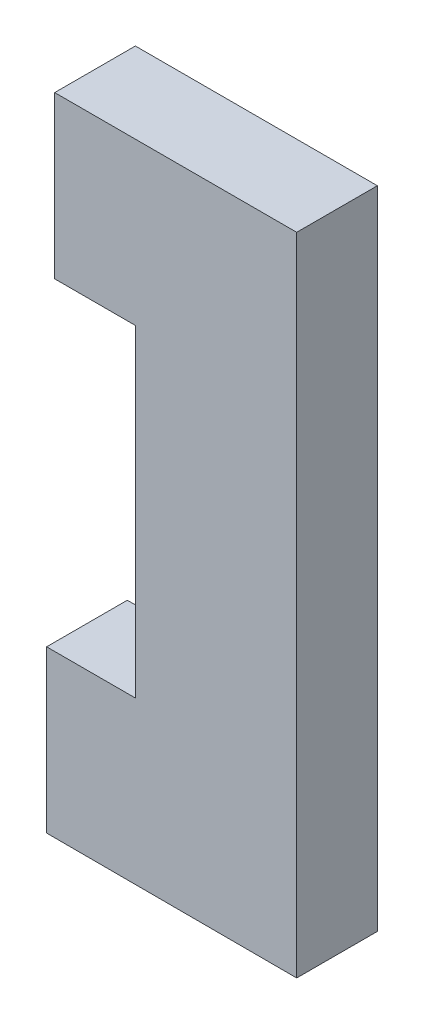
ISO-10303-21;
HEADER;
FILE_DESCRIPTION(('STEP AP214'),'2;1');
FILE_NAME('part.step','',(''),(''),'','','');
FILE_SCHEMA(('AUTOMOTIVE_DESIGN { 1 0 10303 214 1 1 1 1 }'));
ENDSEC;
DATA;
#1=APPLICATION_CONTEXT('core data for automotive mechanical design processes');
#2=APPLICATION_PROTOCOL_DEFINITION('international standard','automotive_design',2000,#1);
#3=PRODUCT_CONTEXT('',#1,'mechanical');
#4=PRODUCT('Part','Part','',(#3));
#5=PRODUCT_RELATED_PRODUCT_CATEGORY('part','',(#4));
#6=PRODUCT_DEFINITION_FORMATION('','',#4);
#7=PRODUCT_DEFINITION_CONTEXT('part definition',#1,'design');
#8=PRODUCT_DEFINITION('design','',#6,#7);
#9=PRODUCT_DEFINITION_SHAPE('','',#8);
#10=(LENGTH_UNIT() NAMED_UNIT(*) SI_UNIT(.MILLI.,.METRE.));
#11=(NAMED_UNIT(*) PLANE_ANGLE_UNIT() SI_UNIT($,.RADIAN.));
#12=(NAMED_UNIT(*) SI_UNIT($,.STERADIAN.) SOLID_ANGLE_UNIT());
#13=UNCERTAINTY_MEASURE_WITH_UNIT(LENGTH_MEASURE(1.E-05),#10,'distance_accuracy_value','');
#14=(GEOMETRIC_REPRESENTATION_CONTEXT(3) GLOBAL_UNCERTAINTY_ASSIGNED_CONTEXT((#13)) GLOBAL_UNIT_ASSIGNED_CONTEXT((#10,
#11,#12)) REPRESENTATION_CONTEXT('',''));
#15=CARTESIAN_POINT('',(0.,0.,0.));
#16=DIRECTION('',(0.,0.,1.));
#17=DIRECTION('',(1.,0.,0.));
#18=AXIS2_PLACEMENT_3D('',#15,#16,#17);
#19=CARTESIAN_POINT('',(17.0216968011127,7.73393602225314,-95.8492172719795));
#20=DIRECTION('',(-1.,0.,0.));
#21=DIRECTION('',(0.,0.,1.));
#22=AXIS2_PLACEMENT_3D('',#19,#20,#21);
#23=PLANE('',#22);
#24=DIRECTION('',(0.,1.,0.));
#25=VECTOR('',#24,1.);
#26=CARTESIAN_POINT('',(17.0216968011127,7.73393602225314,-9.99999999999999));
#27=LINE('',#26,#25);
#28=CARTESIAN_POINT('',(17.0216968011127,7.73393602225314,-9.99999999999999));
#29=VERTEX_POINT('',#28);
#30=CARTESIAN_POINT('',(17.0216968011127,27.7339360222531,-9.99999999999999));
#31=VERTEX_POINT('',#30);
#32=EDGE_CURVE('E59',#29,#31,#27,.T.);
#33=ORIENTED_EDGE('',*,*,#32,.F.);
#34=DIRECTION('',(0.,0.,1.));
#35=VECTOR('',#34,1.);
#36=CARTESIAN_POINT('',(17.0216968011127,7.73393602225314,-95.8492172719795));
#37=LINE('',#36,#35);
#38=CARTESIAN_POINT('',(17.0216968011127,7.73393602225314,0.));
#39=VERTEX_POINT('',#38);
#40=EDGE_CURVE('E117',#29,#39,#37,.T.);
#41=ORIENTED_EDGE('',*,*,#40,.T.);
#42=DIRECTION('',(0.,-1.,0.));
#43=VECTOR('',#42,1.);
#44=CARTESIAN_POINT('',(17.0216968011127,7.73393602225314,0.));
#45=LINE('',#44,#43);
#46=CARTESIAN_POINT('',(17.0216968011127,27.7339360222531,0.));
#47=VERTEX_POINT('',#46);
#48=EDGE_CURVE('E120',#47,#39,#45,.T.);
#49=ORIENTED_EDGE('',*,*,#48,.F.);
#50=DIRECTION('',(0.,0.,1.));
#51=VECTOR('',#50,1.);
#52=CARTESIAN_POINT('',(17.0216968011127,27.7339360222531,-95.8492172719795));
#53=LINE('',#52,#51);
#54=EDGE_CURVE('E93',#31,#47,#53,.T.);
#55=ORIENTED_EDGE('',*,*,#54,.F.);
#56=EDGE_LOOP('',(#33,#41,#49,#55));
#57=FACE_BOUND('',#56,.T.);
#58=ADVANCED_FACE('F49',(#57),#23,.T.);
#59=CARTESIAN_POINT('',(17.0216968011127,27.7339360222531,-95.8492172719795));
#60=DIRECTION('',(0.,1.,0.));
#61=DIRECTION('',(0.,0.,1.));
#62=AXIS2_PLACEMENT_3D('',#59,#60,#61);
#63=PLANE('',#62);
#64=DIRECTION('',(1.,0.,0.));
#65=VECTOR('',#64,1.);
#66=CARTESIAN_POINT('',(17.0216968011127,27.7339360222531,-9.99999999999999));
#67=LINE('',#66,#65);
#68=CARTESIAN_POINT('',(47.0216968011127,27.7339360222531,-9.99999999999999));
#69=VERTEX_POINT('',#68);
#70=EDGE_CURVE('E287',#31,#69,#67,.T.);
#71=ORIENTED_EDGE('',*,*,#70,.F.);
#72=ORIENTED_EDGE('',*,*,#54,.T.);
#73=DIRECTION('',(-1.,0.,0.));
#74=VECTOR('',#73,1.);
#75=CARTESIAN_POINT('',(17.0216968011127,27.7339360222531,0.));
#76=LINE('',#75,#74);
#77=CARTESIAN_POINT('',(47.0216968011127,27.7339360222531,0.));
#78=VERTEX_POINT('',#77);
#79=EDGE_CURVE('E125',#78,#47,#76,.T.);
#80=ORIENTED_EDGE('',*,*,#79,.F.);
#81=DIRECTION('',(0.,0.,1.));
#82=VECTOR('',#81,1.);
#83=CARTESIAN_POINT('',(47.0216968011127,27.7339360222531,-95.8492172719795));
#84=LINE('',#83,#82);
#85=EDGE_CURVE('E190',#69,#78,#84,.T.);
#86=ORIENTED_EDGE('',*,*,#85,.F.);
#87=EDGE_LOOP('',(#71,#72,#80,#86));
#88=FACE_BOUND('',#87,.T.);
#89=ADVANCED_FACE('F286',(#88),#63,.T.);
#90=CARTESIAN_POINT('',(47.0216968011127,27.7339360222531,-95.8492172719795));
#91=DIRECTION('',(1.,0.,0.));
#92=DIRECTION('',(0.,1.,0.));
#93=AXIS2_PLACEMENT_3D('',#90,#91,#92);
#94=PLANE('',#93);
#95=DIRECTION('',(0.,-1.,0.));
#96=VECTOR('',#95,1.);
#97=CARTESIAN_POINT('',(47.0216968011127,27.7339360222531,-9.99999999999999));
#98=LINE('',#97,#96);
#99=CARTESIAN_POINT('',(47.0216968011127,-52.322844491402,-9.99999999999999));
#100=VERTEX_POINT('',#99);
#101=EDGE_CURVE('E290',#69,#100,#98,.T.);
#102=ORIENTED_EDGE('',*,*,#101,.F.);
#103=ORIENTED_EDGE('',*,*,#85,.T.);
#104=DIRECTION('',(0.,1.,0.));
#105=VECTOR('',#104,1.);
#106=CARTESIAN_POINT('',(47.0216968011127,27.7339360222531,0.));
#107=LINE('',#106,#105);
#108=CARTESIAN_POINT('',(47.0216968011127,-52.322844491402,0.));
#109=VERTEX_POINT('',#108);
#110=EDGE_CURVE('E176',#109,#78,#107,.T.);
#111=ORIENTED_EDGE('',*,*,#110,.F.);
#112=DIRECTION('',(0.,0.,1.));
#113=VECTOR('',#112,1.);
#114=CARTESIAN_POINT('',(47.0216968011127,-52.322844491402,-95.8492172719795));
#115=LINE('',#114,#113);
#116=EDGE_CURVE('E194',#100,#109,#115,.T.);
#117=ORIENTED_EDGE('',*,*,#116,.F.);
#118=EDGE_LOOP('',(#102,#103,#111,#117));
#119=FACE_BOUND('',#118,.T.);
#120=ADVANCED_FACE('F289',(#119),#94,.T.);
#121=CARTESIAN_POINT('',(47.0216968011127,-52.322844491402,-95.8492172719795));
#122=DIRECTION('',(-0.00183162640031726,-0.999998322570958,0.));
#123=DIRECTION('',(0.999998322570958,-0.00183162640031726,0.));
#124=AXIS2_PLACEMENT_3D('',#121,#122,#123);
#125=PLANE('',#124);
#126=DIRECTION('',(-0.999998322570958,0.00183162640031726,0.));
#127=VECTOR('',#126,1.);
#128=CARTESIAN_POINT('',(47.0216968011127,-52.322844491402,-9.99999999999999));
#129=LINE('',#128,#127);
#130=CARTESIAN_POINT('',(16.0216968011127,-52.2660639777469,-9.99999999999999));
#131=VERTEX_POINT('',#130);
#132=EDGE_CURVE('E231',#100,#131,#129,.T.);
#133=ORIENTED_EDGE('',*,*,#132,.F.);
#134=ORIENTED_EDGE('',*,*,#116,.T.);
#135=DIRECTION('',(0.999998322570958,-0.00183162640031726,0.));
#136=VECTOR('',#135,1.);
#137=CARTESIAN_POINT('',(47.0216968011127,-52.322844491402,0.));
#138=LINE('',#137,#136);
#139=CARTESIAN_POINT('',(16.0216968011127,-52.2660639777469,0.));
#140=VERTEX_POINT('',#139);
#141=EDGE_CURVE('E270',#140,#109,#138,.T.);
#142=ORIENTED_EDGE('',*,*,#141,.F.);
#143=DIRECTION('',(0.,0.,1.));
#144=VECTOR('',#143,1.);
#145=CARTESIAN_POINT('',(16.0216968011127,-52.2660639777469,-95.8492172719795));
#146=LINE('',#145,#144);
#147=EDGE_CURVE('E209',#131,#140,#146,.T.);
#148=ORIENTED_EDGE('',*,*,#147,.F.);
#149=EDGE_LOOP('',(#133,#134,#142,#148));
#150=FACE_BOUND('',#149,.T.);
#151=ADVANCED_FACE('F316',(#150),#125,.T.);
#152=CARTESIAN_POINT('',(16.0216968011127,-52.2660639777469,-95.8492172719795));
#153=DIRECTION('',(-1.,0.,0.));
#154=DIRECTION('',(0.,-1.,0.));
#155=AXIS2_PLACEMENT_3D('',#152,#153,#154);
#156=PLANE('',#155);
#157=DIRECTION('',(0.,1.,0.));
#158=VECTOR('',#157,1.);
#159=CARTESIAN_POINT('',(16.0216968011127,-52.2660639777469,-9.99999999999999));
#160=LINE('',#159,#158);
#161=CARTESIAN_POINT('',(16.0216968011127,-32.2660639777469,-9.99999999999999));
#162=VERTEX_POINT('',#161);
#163=EDGE_CURVE('E226',#131,#162,#160,.T.);
#164=ORIENTED_EDGE('',*,*,#163,.F.);
#165=ORIENTED_EDGE('',*,*,#147,.T.);
#166=DIRECTION('',(0.,-1.,0.));
#167=VECTOR('',#166,1.);
#168=CARTESIAN_POINT('',(16.0216968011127,-52.2660639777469,0.));
#169=LINE('',#168,#167);
#170=CARTESIAN_POINT('',(16.0216968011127,-32.2660639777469,0.));
#171=VERTEX_POINT('',#170);
#172=EDGE_CURVE('E266',#171,#140,#169,.T.);
#173=ORIENTED_EDGE('',*,*,#172,.F.);
#174=DIRECTION('',(0.,0.,1.));
#175=VECTOR('',#174,1.);
#176=CARTESIAN_POINT('',(16.0216968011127,-32.2660639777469,-95.8492172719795));
#177=LINE('',#176,#175);
#178=EDGE_CURVE('E212',#162,#171,#177,.T.);
#179=ORIENTED_EDGE('',*,*,#178,.F.);
#180=EDGE_LOOP('',(#164,#165,#173,#179));
#181=FACE_BOUND('',#180,.T.);
#182=ADVANCED_FACE('F314',(#181),#156,.T.);
#183=CARTESIAN_POINT('',(16.0216968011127,-32.2660639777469,-95.8492172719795));
#184=DIRECTION('',(0.,1.,0.));
#185=DIRECTION('',(0.,0.,1.));
#186=AXIS2_PLACEMENT_3D('',#183,#184,#185);
#187=PLANE('',#186);
#188=DIRECTION('',(1.,0.,0.));
#189=VECTOR('',#188,1.);
#190=CARTESIAN_POINT('',(16.0216968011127,-32.2660639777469,-9.99999999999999));
#191=LINE('',#190,#189);
#192=CARTESIAN_POINT('',(27.0216968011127,-32.2660639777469,-9.99999999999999));
#193=VERTEX_POINT('',#192);
#194=EDGE_CURVE('E232',#162,#193,#191,.T.);
#195=ORIENTED_EDGE('',*,*,#194,.F.);
#196=ORIENTED_EDGE('',*,*,#178,.T.);
#197=DIRECTION('',(-1.,0.,0.));
#198=VECTOR('',#197,1.);
#199=CARTESIAN_POINT('',(16.0216968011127,-32.2660639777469,0.));
#200=LINE('',#199,#198);
#201=CARTESIAN_POINT('',(27.0216968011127,-32.2660639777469,0.));
#202=VERTEX_POINT('',#201);
#203=EDGE_CURVE('E258',#202,#171,#200,.T.);
#204=ORIENTED_EDGE('',*,*,#203,.F.);
#205=DIRECTION('',(0.,0.,1.));
#206=VECTOR('',#205,1.);
#207=CARTESIAN_POINT('',(27.0216968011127,-32.2660639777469,-95.8492172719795));
#208=LINE('',#207,#206);
#209=EDGE_CURVE('E323',#193,#202,#208,.T.);
#210=ORIENTED_EDGE('',*,*,#209,.F.);
#211=EDGE_LOOP('',(#195,#196,#204,#210));
#212=FACE_BOUND('',#211,.T.);
#213=ADVANCED_FACE('F322',(#212),#187,.T.);
#214=CARTESIAN_POINT('',(27.0216968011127,-32.2660639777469,-95.8492172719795));
#215=DIRECTION('',(-1.,0.,0.));
#216=DIRECTION('',(0.,0.,1.));
#217=AXIS2_PLACEMENT_3D('',#214,#215,#216);
#218=PLANE('',#217);
#219=DIRECTION('',(0.,1.,0.));
#220=VECTOR('',#219,1.);
#221=CARTESIAN_POINT('',(27.0216968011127,-32.2660639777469,-9.99999999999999));
#222=LINE('',#221,#220);
#223=CARTESIAN_POINT('',(27.0216968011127,7.73393602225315,-9.99999999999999));
#224=VERTEX_POINT('',#223);
#225=EDGE_CURVE('E86',#193,#224,#222,.T.);
#226=ORIENTED_EDGE('',*,*,#225,.F.);
#227=ORIENTED_EDGE('',*,*,#209,.T.);
#228=DIRECTION('',(0.,-1.,0.));
#229=VECTOR('',#228,1.);
#230=CARTESIAN_POINT('',(27.0216968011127,-32.2660639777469,0.));
#231=LINE('',#230,#229);
#232=CARTESIAN_POINT('',(27.0216968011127,7.73393602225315,0.));
#233=VERTEX_POINT('',#232);
#234=EDGE_CURVE('E133',#233,#202,#231,.T.);
#235=ORIENTED_EDGE('',*,*,#234,.F.);
#236=DIRECTION('',(0.,0.,1.));
#237=VECTOR('',#236,1.);
#238=CARTESIAN_POINT('',(27.0216968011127,7.73393602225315,-95.8492172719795));
#239=LINE('',#238,#237);
#240=EDGE_CURVE('E124',#224,#233,#239,.T.);
#241=ORIENTED_EDGE('',*,*,#240,.F.);
#242=EDGE_LOOP('',(#226,#227,#235,#241));
#243=FACE_BOUND('',#242,.T.);
#244=ADVANCED_FACE('F332',(#243),#218,.T.);
#245=CARTESIAN_POINT('',(27.0216968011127,7.73393602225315,-95.8492172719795));
#246=DIRECTION('',(0.,-1.,0.));
#247=DIRECTION('',(1.,0.,0.));
#248=AXIS2_PLACEMENT_3D('',#245,#246,#247);
#249=PLANE('',#248);
#250=DIRECTION('',(-1.,0.,0.));
#251=VECTOR('',#250,1.);
#252=CARTESIAN_POINT('',(27.0216968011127,7.73393602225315,-9.99999999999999));
#253=LINE('',#252,#251);
#254=EDGE_CURVE('E12',#224,#29,#253,.T.);
#255=ORIENTED_EDGE('',*,*,#254,.F.);
#256=ORIENTED_EDGE('',*,*,#240,.T.);
#257=DIRECTION('',(1.,0.,0.));
#258=VECTOR('',#257,1.);
#259=CARTESIAN_POINT('',(27.0216968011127,7.73393602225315,0.));
#260=LINE('',#259,#258);
#261=EDGE_CURVE('E127',#39,#233,#260,.T.);
#262=ORIENTED_EDGE('',*,*,#261,.F.);
#263=ORIENTED_EDGE('',*,*,#40,.F.);
#264=EDGE_LOOP('',(#255,#256,#262,#263));
#265=FACE_BOUND('',#264,.T.);
#266=ADVANCED_FACE('F128',(#265),#249,.T.);
#267=CARTESIAN_POINT('',(17.0216968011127,27.7339360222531,0.));
#268=DIRECTION('',(0.,0.,-1.));
#269=DIRECTION('',(-1.,0.,0.));
#270=AXIS2_PLACEMENT_3D('',#267,#268,#269);
#271=PLANE('',#270);
#272=ORIENTED_EDGE('',*,*,#48,.T.);
#273=ORIENTED_EDGE('',*,*,#261,.T.);
#274=ORIENTED_EDGE('',*,*,#234,.T.);
#275=ORIENTED_EDGE('',*,*,#203,.T.);
#276=ORIENTED_EDGE('',*,*,#172,.T.);
#277=ORIENTED_EDGE('',*,*,#141,.T.);
#278=ORIENTED_EDGE('',*,*,#110,.T.);
#279=ORIENTED_EDGE('',*,*,#79,.T.);
#280=EDGE_LOOP('',(#272,#273,#274,#275,#276,#277,#278,#279));
#281=FACE_BOUND('',#280,.T.);
#282=ADVANCED_FACE('F134',(#281),#271,.F.);
#283=CARTESIAN_POINT('',(14.5216968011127,7.73393602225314,-10.));
#284=DIRECTION('',(0.,0.,1.));
#285=DIRECTION('',(1.,0.,0.));
#286=AXIS2_PLACEMENT_3D('',#283,#284,#285);
#287=PLANE('',#286);
#288=ORIENTED_EDGE('',*,*,#32,.T.);
#289=ORIENTED_EDGE('',*,*,#70,.T.);
#290=ORIENTED_EDGE('',*,*,#101,.T.);
#291=ORIENTED_EDGE('',*,*,#132,.T.);
#292=ORIENTED_EDGE('',*,*,#163,.T.);
#293=ORIENTED_EDGE('',*,*,#194,.T.);
#294=ORIENTED_EDGE('',*,*,#225,.T.);
#295=ORIENTED_EDGE('',*,*,#254,.T.);
#296=EDGE_LOOP('',(#288,#289,#290,#291,#292,#293,#294,#295));
#297=FACE_BOUND('',#296,.T.);
#298=ADVANCED_FACE('F308',(#297),#287,.F.);
#299=CLOSED_SHELL('',(#58,#89,#120,#151,#182,#213,#244,#266,#282,#298));
#300=MANIFOLD_SOLID_BREP('B2',#299);
#301=ADVANCED_BREP_SHAPE_REPRESENTATION('',(#18,#300),#14);
#302=SHAPE_DEFINITION_REPRESENTATION(#9,#301);
ENDSEC;
END-ISO-10303-21;
